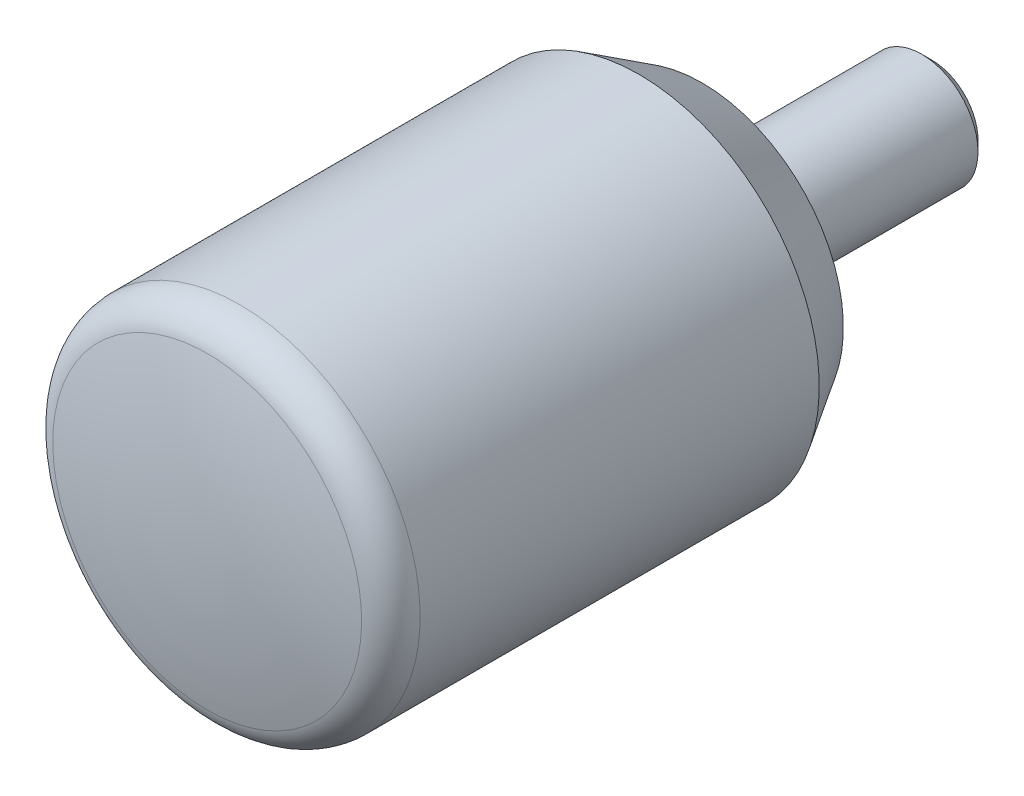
ISO-10303-21;
HEADER;
FILE_DESCRIPTION(('STEP AP214'),'2;1');
FILE_NAME('part.step','',(''),(''),'','','');
FILE_SCHEMA(('AUTOMOTIVE_DESIGN { 1 0 10303 214 1 1 1 1 }'));
ENDSEC;
DATA;
#1=APPLICATION_CONTEXT('core data for automotive mechanical design processes');
#2=APPLICATION_PROTOCOL_DEFINITION('international standard','automotive_design',2000,#1);
#3=PRODUCT_CONTEXT('',#1,'mechanical');
#4=PRODUCT('Part','Part','',(#3));
#5=PRODUCT_RELATED_PRODUCT_CATEGORY('part','',(#4));
#6=PRODUCT_DEFINITION_FORMATION('','',#4);
#7=PRODUCT_DEFINITION_CONTEXT('part definition',#1,'design');
#8=PRODUCT_DEFINITION('design','',#6,#7);
#9=PRODUCT_DEFINITION_SHAPE('','',#8);
#10=(LENGTH_UNIT() NAMED_UNIT(*) SI_UNIT(.MILLI.,.METRE.));
#11=(NAMED_UNIT(*) PLANE_ANGLE_UNIT() SI_UNIT($,.RADIAN.));
#12=(NAMED_UNIT(*) SI_UNIT($,.STERADIAN.) SOLID_ANGLE_UNIT());
#13=UNCERTAINTY_MEASURE_WITH_UNIT(LENGTH_MEASURE(1.E-05),#10,'distance_accuracy_value','');
#14=(GEOMETRIC_REPRESENTATION_CONTEXT(3) GLOBAL_UNCERTAINTY_ASSIGNED_CONTEXT((#13)) GLOBAL_UNIT_ASSIGNED_CONTEXT((#10,
#11,#12)) REPRESENTATION_CONTEXT('',''));
#15=CARTESIAN_POINT('',(0.,0.,0.));
#16=DIRECTION('',(0.,0.,1.));
#17=DIRECTION('',(1.,0.,0.));
#18=AXIS2_PLACEMENT_3D('',#15,#16,#17);
#19=CARTESIAN_POINT('',(0.,2.5000000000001,0.));
#20=DIRECTION('',(0.,0.,-1.));
#21=DIRECTION('',(0.,-1.,0.));
#22=AXIS2_PLACEMENT_3D('',#19,#20,#21);
#23=PLANE('',#22);
#24=CARTESIAN_POINT('',(0.,0.,0.));
#25=DIRECTION('',(0.,0.,-1.));
#26=DIRECTION('',(0.,-1.,0.));
#27=AXIS2_PLACEMENT_3D('',#24,#25,#26);
#28=CIRCLE('',#27,4.00000000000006);
#29=CARTESIAN_POINT('',(0.,-4.00000000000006,0.));
#30=VERTEX_POINT('',#29);
#31=EDGE_CURVE('E116',#30,#30,#28,.T.);
#32=ORIENTED_EDGE('',*,*,#31,.T.);
#33=EDGE_LOOP('',(#32));
#34=FACE_BOUND('',#33,.T.);
#35=CARTESIAN_POINT('',(0.,0.,0.));
#36=DIRECTION('',(0.,0.,-1.));
#37=DIRECTION('',(0.,-1.,0.));
#38=AXIS2_PLACEMENT_3D('',#35,#36,#37);
#39=CIRCLE('',#38,2.50000000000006);
#40=CARTESIAN_POINT('',(0.,-2.50000000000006,0.));
#41=VERTEX_POINT('',#40);
#42=EDGE_CURVE('E139',#41,#41,#39,.T.);
#43=ORIENTED_EDGE('',*,*,#42,.F.);
#44=EDGE_LOOP('',(#43));
#45=FACE_BOUND('',#44,.T.);
#46=ADVANCED_FACE('F14',(#34,#45),#23,.T.);
#47=CARTESIAN_POINT('',(0.,0.,-15.2));
#48=DIRECTION('',(0.,0.,-1.));
#49=DIRECTION('',(0.,-1.,0.));
#50=AXIS2_PLACEMENT_3D('',#47,#48,#49);
#51=CYLINDRICAL_SURFACE('',#50,2.50000000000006);
#52=CARTESIAN_POINT('',(0.,0.,-9.55));
#53=DIRECTION('',(0.,0.,-1.));
#54=DIRECTION('',(0.,1.,0.));
#55=AXIS2_PLACEMENT_3D('',#52,#53,#54);
#56=CIRCLE('',#55,2.50000000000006);
#57=CARTESIAN_POINT('',(0.,2.50000000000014,-9.55));
#58=VERTEX_POINT('',#57);
#59=EDGE_CURVE('E9',#58,#58,#56,.F.);
#60=ORIENTED_EDGE('',*,*,#59,.T.);
#61=EDGE_LOOP('',(#60));
#62=FACE_BOUND('',#61,.T.);
#63=ORIENTED_EDGE('',*,*,#42,.T.);
#64=EDGE_LOOP('',(#63));
#65=FACE_BOUND('',#64,.T.);
#66=ADVANCED_FACE('F158',(#62,#65),#51,.T.);
#67=CARTESIAN_POINT('',(0.,1.2490009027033E-13,-10.));
#68=DIRECTION('',(0.,0.,-1.));
#69=DIRECTION('',(0.,-1.,0.));
#70=AXIS2_PLACEMENT_3D('',#67,#68,#69);
#71=PLANE('',#70);
#72=CARTESIAN_POINT('',(0.,0.,-10.));
#73=DIRECTION('',(0.,0.,-1.));
#74=DIRECTION('',(0.,1.,0.));
#75=AXIS2_PLACEMENT_3D('',#72,#73,#74);
#76=CIRCLE('',#75,2.05);
#77=CARTESIAN_POINT('',(0.,2.05000000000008,-10.));
#78=VERTEX_POINT('',#77);
#79=EDGE_CURVE('E22',#78,#78,#76,.T.);
#80=ORIENTED_EDGE('',*,*,#79,.T.);
#81=EDGE_LOOP('',(#80));
#82=FACE_BOUND('',#81,.T.);
#83=DIRECTION('',(0.866025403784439,0.5,0.));
#84=VECTOR('',#83,1.);
#85=CARTESIAN_POINT('',(-1.25,0.721687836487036,-10.));
#86=LINE('',#85,#84);
#87=CARTESIAN_POINT('',(-1.25,0.721687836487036,-10.));
#88=VERTEX_POINT('',#87);
#89=CARTESIAN_POINT('',(0.,1.44337567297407,-10.));
#90=VERTEX_POINT('',#89);
#91=EDGE_CURVE('E29',#88,#90,#86,.T.);
#92=ORIENTED_EDGE('',*,*,#91,.F.);
#93=DIRECTION('',(0.,1.,0.));
#94=VECTOR('',#93,1.);
#95=CARTESIAN_POINT('',(-1.25,-0.72168783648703,-10.));
#96=LINE('',#95,#94);
#97=CARTESIAN_POINT('',(-1.25,-0.72168783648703,-10.));
#98=VERTEX_POINT('',#97);
#99=EDGE_CURVE('E112',#98,#88,#96,.T.);
#100=ORIENTED_EDGE('',*,*,#99,.F.);
#101=DIRECTION('',(-0.866025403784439,0.5,0.));
#102=VECTOR('',#101,1.);
#103=CARTESIAN_POINT('',(0.,-1.44337567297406,-10.));
#104=LINE('',#103,#102);
#105=CARTESIAN_POINT('',(0.,-1.44337567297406,-10.));
#106=VERTEX_POINT('',#105);
#107=EDGE_CURVE('E110',#106,#98,#104,.T.);
#108=ORIENTED_EDGE('',*,*,#107,.F.);
#109=DIRECTION('',(-0.866025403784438,-0.5,0.));
#110=VECTOR('',#109,1.);
#111=CARTESIAN_POINT('',(1.25,-0.72168783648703,-10.));
#112=LINE('',#111,#110);
#113=CARTESIAN_POINT('',(1.25,-0.72168783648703,-10.));
#114=VERTEX_POINT('',#113);
#115=EDGE_CURVE('E77',#114,#106,#112,.T.);
#116=ORIENTED_EDGE('',*,*,#115,.F.);
#117=DIRECTION('',(0.,-1.,0.));
#118=VECTOR('',#117,1.);
#119=CARTESIAN_POINT('',(1.25,0.721687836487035,-10.));
#120=LINE('',#119,#118);
#121=CARTESIAN_POINT('',(1.25,0.721687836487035,-10.));
#122=VERTEX_POINT('',#121);
#123=EDGE_CURVE('E106',#122,#114,#120,.T.);
#124=ORIENTED_EDGE('',*,*,#123,.F.);
#125=DIRECTION('',(0.866025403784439,-0.5,0.));
#126=VECTOR('',#125,1.);
#127=CARTESIAN_POINT('',(0.,1.44337567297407,-10.));
#128=LINE('',#127,#126);
#129=EDGE_CURVE('E103',#90,#122,#128,.T.);
#130=ORIENTED_EDGE('',*,*,#129,.F.);
#131=EDGE_LOOP('',(#92,#100,#108,#116,#124,#130));
#132=FACE_BOUND('',#131,.T.);
#133=ADVANCED_FACE('F144',(#82,#132),#71,.T.);
#134=CARTESIAN_POINT('',(0.,0.,-5.90000000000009));
#135=DIRECTION('',(-1.,0.,0.));
#136=DIRECTION('',(0.,0.,1.));
#137=AXIS2_PLACEMENT_3D('',#134,#135,#136);
#138=SPHERICAL_SURFACE('',#137,28.9);
#139=CARTESIAN_POINT('',(0.,0.,-5.90000000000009));
#140=DIRECTION('',(0.,0.,-1.));
#141=DIRECTION('',(0.,-1.,0.));
#142=AXIS2_PLACEMENT_3D('',#139,#140,#141);
#143=SPHERICAL_SURFACE('',#142,28.9);
#144=CARTESIAN_POINT('',(0.,0.,22.1750327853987));
#145=DIRECTION('',(0.,0.,-1.));
#146=DIRECTION('',(0.,-1.,0.));
#147=AXIS2_PLACEMENT_3D('',#144,#145,#146);
#148=CIRCLE('',#147,6.85583941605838);
#149=CARTESIAN_POINT('',(0.,-6.85583941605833,22.1750327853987));
#150=VERTEX_POINT('',#149);
#151=EDGE_CURVE('E136',#150,#150,#148,.T.);
#152=ORIENTED_EDGE('',*,*,#151,.F.);
#153=EDGE_LOOP('',(#152));
#154=FACE_BOUND('',#153,.T.);
#155=ADVANCED_FACE('F170',(#154),#143,.T.);
#156=CARTESIAN_POINT('',(0.,0.,20.7178511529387));
#157=DIRECTION('',(0.,0.,-1.));
#158=DIRECTION('',(0.,-1.,0.));
#159=AXIS2_PLACEMENT_3D('',#156,#157,#158);
#160=TOROIDAL_SURFACE('',#159,6.5,1.50000000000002);
#161=CARTESIAN_POINT('',(0.,0.,20.7178511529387));
#162=DIRECTION('',(0.,0.,-1.));
#163=DIRECTION('',(0.,-1.,0.));
#164=AXIS2_PLACEMENT_3D('',#161,#162,#163);
#165=CIRCLE('',#164,8.);
#166=CARTESIAN_POINT('',(0.,-7.99999999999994,20.7178511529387));
#167=VERTEX_POINT('',#166);
#168=EDGE_CURVE('E133',#167,#167,#165,.T.);
#169=ORIENTED_EDGE('',*,*,#168,.F.);
#170=EDGE_LOOP('',(#169));
#171=FACE_BOUND('',#170,.T.);
#172=ORIENTED_EDGE('',*,*,#151,.T.);
#173=EDGE_LOOP('',(#172));
#174=FACE_BOUND('',#173,.T.);
#175=ADVANCED_FACE('F173',(#171,#174),#160,.T.);
#176=CARTESIAN_POINT('',(0.,0.,-15.2));
#177=DIRECTION('',(0.,0.,-1.));
#178=DIRECTION('',(0.,-1.,0.));
#179=AXIS2_PLACEMENT_3D('',#176,#177,#178);
#180=CYLINDRICAL_SURFACE('',#179,8.);
#181=CARTESIAN_POINT('',(0.,0.,2.99999999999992));
#182=DIRECTION('',(0.,0.,-1.));
#183=DIRECTION('',(0.,-1.,0.));
#184=AXIS2_PLACEMENT_3D('',#181,#182,#183);
#185=CIRCLE('',#184,8.);
#186=CARTESIAN_POINT('',(0.,-7.99999999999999,2.99999999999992));
#187=VERTEX_POINT('',#186);
#188=EDGE_CURVE('E130',#187,#187,#185,.T.);
#189=ORIENTED_EDGE('',*,*,#188,.F.);
#190=EDGE_LOOP('',(#189));
#191=FACE_BOUND('',#190,.T.);
#192=ORIENTED_EDGE('',*,*,#168,.T.);
#193=EDGE_LOOP('',(#192));
#194=FACE_BOUND('',#193,.T.);
#195=ADVANCED_FACE('F177',(#191,#194),#180,.T.);
#196=CARTESIAN_POINT('',(0.,0.,0.200000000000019));
#197=DIRECTION('',(0.,0.,1.));
#198=DIRECTION('',(0.,1.,0.));
#199=AXIS2_PLACEMENT_3D('',#196,#197,#198);
#200=CONICAL_SURFACE('',#199,6.27256140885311,0.552784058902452);
#201=ORIENTED_EDGE('',*,*,#188,.T.);
#202=EDGE_LOOP('',(#201));
#203=FACE_BOUND('',#202,.T.);
#204=CARTESIAN_POINT('',(0.,0.,0.200000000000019));
#205=DIRECTION('',(0.,0.,-1.));
#206=DIRECTION('',(0.,-1.,0.));
#207=AXIS2_PLACEMENT_3D('',#204,#205,#206);
#208=CIRCLE('',#207,6.27256140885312);
#209=CARTESIAN_POINT('',(0.,-6.27256140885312,0.200000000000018));
#210=VERTEX_POINT('',#209);
#211=EDGE_CURVE('E127',#210,#210,#208,.T.);
#212=ORIENTED_EDGE('',*,*,#211,.F.);
#213=EDGE_LOOP('',(#212));
#214=FACE_BOUND('',#213,.T.);
#215=ADVANCED_FACE('F181',(#203,#214),#200,.T.);
#216=CARTESIAN_POINT('',(0.,4.0000000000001,0.199999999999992));
#217=DIRECTION('',(0.,0.,-1.));
#218=DIRECTION('',(0.,-1.,0.));
#219=AXIS2_PLACEMENT_3D('',#216,#217,#218);
#220=PLANE('',#219);
#221=ORIENTED_EDGE('',*,*,#211,.T.);
#222=EDGE_LOOP('',(#221));
#223=FACE_BOUND('',#222,.T.);
#224=CARTESIAN_POINT('',(0.,0.,0.199999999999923));
#225=DIRECTION('',(0.,0.,-1.));
#226=DIRECTION('',(0.,-1.,0.));
#227=AXIS2_PLACEMENT_3D('',#224,#225,#226);
#228=CIRCLE('',#227,4.00000000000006);
#229=CARTESIAN_POINT('',(0.,-4.00000000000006,0.199999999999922));
#230=VERTEX_POINT('',#229);
#231=EDGE_CURVE('E124',#230,#230,#228,.T.);
#232=ORIENTED_EDGE('',*,*,#231,.F.);
#233=EDGE_LOOP('',(#232));
#234=FACE_BOUND('',#233,.T.);
#235=ADVANCED_FACE('F185',(#223,#234),#220,.T.);
#236=CARTESIAN_POINT('',(0.,0.,-15.2));
#237=DIRECTION('',(0.,0.,-1.));
#238=DIRECTION('',(0.,-1.,0.));
#239=AXIS2_PLACEMENT_3D('',#236,#237,#238);
#240=CYLINDRICAL_SURFACE('',#239,4.00000000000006);
#241=ORIENTED_EDGE('',*,*,#231,.T.);
#242=EDGE_LOOP('',(#241));
#243=FACE_BOUND('',#242,.T.);
#244=ORIENTED_EDGE('',*,*,#31,.F.);
#245=EDGE_LOOP('',(#244));
#246=FACE_BOUND('',#245,.T.);
#247=ADVANCED_FACE('F189',(#243,#246),#240,.T.);
#248=CARTESIAN_POINT('',(-1.25,0.721687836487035,-7.));
#249=DIRECTION('',(-0.5,0.866025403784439,0.));
#250=DIRECTION('',(-0.866025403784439,-0.5,0.));
#251=AXIS2_PLACEMENT_3D('',#248,#249,#250);
#252=PLANE('',#251);
#253=ORIENTED_EDGE('',*,*,#91,.T.);
#254=DIRECTION('',(0.,0.,-1.));
#255=VECTOR('',#254,1.);
#256=CARTESIAN_POINT('',(0.,1.44337567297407,-7.));
#257=LINE('',#256,#255);
#258=CARTESIAN_POINT('',(0.,1.44337567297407,-7.));
#259=VERTEX_POINT('',#258);
#260=EDGE_CURVE('E59',#259,#90,#257,.T.);
#261=ORIENTED_EDGE('',*,*,#260,.F.);
#262=DIRECTION('',(0.866025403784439,0.5,0.));
#263=VECTOR('',#262,1.);
#264=CARTESIAN_POINT('',(-1.25,0.721687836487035,-7.));
#265=LINE('',#264,#263);
#266=CARTESIAN_POINT('',(-1.25,0.721687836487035,-7.));
#267=VERTEX_POINT('',#266);
#268=EDGE_CURVE('E114',#267,#259,#265,.T.);
#269=ORIENTED_EDGE('',*,*,#268,.F.);
#270=DIRECTION('',(0.,0.,-1.));
#271=VECTOR('',#270,1.);
#272=CARTESIAN_POINT('',(-1.25,0.721687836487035,-7.));
#273=LINE('',#272,#271);
#274=EDGE_CURVE('E37',#267,#88,#273,.T.);
#275=ORIENTED_EDGE('',*,*,#274,.T.);
#276=EDGE_LOOP('',(#253,#261,#269,#275));
#277=FACE_BOUND('',#276,.T.);
#278=ADVANCED_FACE('F193',(#277),#252,.F.);
#279=CARTESIAN_POINT('',(-1.25,-0.721687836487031,-7.));
#280=DIRECTION('',(-1.,0.,0.));
#281=DIRECTION('',(0.,0.,1.));
#282=AXIS2_PLACEMENT_3D('',#279,#280,#281);
#283=PLANE('',#282);
#284=ORIENTED_EDGE('',*,*,#99,.T.);
#285=ORIENTED_EDGE('',*,*,#274,.F.);
#286=DIRECTION('',(0.,1.,0.));
#287=VECTOR('',#286,1.);
#288=CARTESIAN_POINT('',(-1.25,-0.721687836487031,-7.));
#289=LINE('',#288,#287);
#290=CARTESIAN_POINT('',(-1.25,-0.721687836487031,-7.));
#291=VERTEX_POINT('',#290);
#292=EDGE_CURVE('E89',#291,#267,#289,.T.);
#293=ORIENTED_EDGE('',*,*,#292,.F.);
#294=DIRECTION('',(0.,0.,-1.));
#295=VECTOR('',#294,1.);
#296=CARTESIAN_POINT('',(-1.25,-0.721687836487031,-7.));
#297=LINE('',#296,#295);
#298=EDGE_CURVE('E81',#291,#98,#297,.T.);
#299=ORIENTED_EDGE('',*,*,#298,.T.);
#300=EDGE_LOOP('',(#284,#285,#293,#299));
#301=FACE_BOUND('',#300,.T.);
#302=ADVANCED_FACE('F197',(#301),#283,.F.);
#303=CARTESIAN_POINT('',(0.,-1.44337567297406,-7.));
#304=DIRECTION('',(-0.5,-0.866025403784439,0.));
#305=DIRECTION('',(0.866025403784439,-0.5,0.));
#306=AXIS2_PLACEMENT_3D('',#303,#304,#305);
#307=PLANE('',#306);
#308=ORIENTED_EDGE('',*,*,#107,.T.);
#309=ORIENTED_EDGE('',*,*,#298,.F.);
#310=DIRECTION('',(-0.866025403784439,0.5,0.));
#311=VECTOR('',#310,1.);
#312=CARTESIAN_POINT('',(0.,-1.44337567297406,-7.));
#313=LINE('',#312,#311);
#314=CARTESIAN_POINT('',(0.,-1.44337567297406,-7.));
#315=VERTEX_POINT('',#314);
#316=EDGE_CURVE('E85',#315,#291,#313,.T.);
#317=ORIENTED_EDGE('',*,*,#316,.F.);
#318=DIRECTION('',(0.,0.,-1.));
#319=VECTOR('',#318,1.);
#320=CARTESIAN_POINT('',(0.,-1.44337567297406,-7.));
#321=LINE('',#320,#319);
#322=EDGE_CURVE('E70',#315,#106,#321,.T.);
#323=ORIENTED_EDGE('',*,*,#322,.T.);
#324=EDGE_LOOP('',(#308,#309,#317,#323));
#325=FACE_BOUND('',#324,.T.);
#326=ADVANCED_FACE('F86',(#325),#307,.F.);
#327=CARTESIAN_POINT('',(1.25,-0.721687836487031,-7.));
#328=DIRECTION('',(0.5,-0.866025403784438,0.));
#329=DIRECTION('',(0.866025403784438,0.5,0.));
#330=AXIS2_PLACEMENT_3D('',#327,#328,#329);
#331=PLANE('',#330);
#332=ORIENTED_EDGE('',*,*,#115,.T.);
#333=ORIENTED_EDGE('',*,*,#322,.F.);
#334=DIRECTION('',(-0.866025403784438,-0.5,0.));
#335=VECTOR('',#334,1.);
#336=CARTESIAN_POINT('',(1.25,-0.721687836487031,-7.));
#337=LINE('',#336,#335);
#338=CARTESIAN_POINT('',(1.25,-0.721687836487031,-7.));
#339=VERTEX_POINT('',#338);
#340=EDGE_CURVE('E74',#339,#315,#337,.T.);
#341=ORIENTED_EDGE('',*,*,#340,.F.);
#342=DIRECTION('',(0.,0.,-1.));
#343=VECTOR('',#342,1.);
#344=CARTESIAN_POINT('',(1.25,-0.721687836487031,-7.));
#345=LINE('',#344,#343);
#346=EDGE_CURVE('E82',#339,#114,#345,.T.);
#347=ORIENTED_EDGE('',*,*,#346,.T.);
#348=EDGE_LOOP('',(#332,#333,#341,#347));
#349=FACE_BOUND('',#348,.T.);
#350=ADVANCED_FACE('F72',(#349),#331,.F.);
#351=CARTESIAN_POINT('',(1.25,0.721687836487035,-7.));
#352=DIRECTION('',(1.,0.,0.));
#353=DIRECTION('',(0.,1.,0.));
#354=AXIS2_PLACEMENT_3D('',#351,#352,#353);
#355=PLANE('',#354);
#356=ORIENTED_EDGE('',*,*,#123,.T.);
#357=ORIENTED_EDGE('',*,*,#346,.F.);
#358=DIRECTION('',(0.,-1.,0.));
#359=VECTOR('',#358,1.);
#360=CARTESIAN_POINT('',(1.25,0.721687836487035,-7.));
#361=LINE('',#360,#359);
#362=CARTESIAN_POINT('',(1.25,0.721687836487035,-7.));
#363=VERTEX_POINT('',#362);
#364=EDGE_CURVE('E95',#363,#339,#361,.T.);
#365=ORIENTED_EDGE('',*,*,#364,.F.);
#366=DIRECTION('',(0.,0.,-1.));
#367=VECTOR('',#366,1.);
#368=CARTESIAN_POINT('',(1.25,0.721687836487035,-7.));
#369=LINE('',#368,#367);
#370=EDGE_CURVE('E119',#363,#122,#369,.T.);
#371=ORIENTED_EDGE('',*,*,#370,.T.);
#372=EDGE_LOOP('',(#356,#357,#365,#371));
#373=FACE_BOUND('',#372,.T.);
#374=ADVANCED_FACE('F200',(#373),#355,.F.);
#375=CARTESIAN_POINT('',(0.,1.44337567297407,-7.));
#376=DIRECTION('',(0.5,0.866025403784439,0.));
#377=DIRECTION('',(-0.866025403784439,0.5,0.));
#378=AXIS2_PLACEMENT_3D('',#375,#376,#377);
#379=PLANE('',#378);
#380=ORIENTED_EDGE('',*,*,#129,.T.);
#381=ORIENTED_EDGE('',*,*,#370,.F.);
#382=DIRECTION('',(0.866025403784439,-0.5,0.));
#383=VECTOR('',#382,1.);
#384=CARTESIAN_POINT('',(0.,1.44337567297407,-7.));
#385=LINE('',#384,#383);
#386=EDGE_CURVE('E97',#259,#363,#385,.T.);
#387=ORIENTED_EDGE('',*,*,#386,.F.);
#388=ORIENTED_EDGE('',*,*,#260,.T.);
#389=EDGE_LOOP('',(#380,#381,#387,#388));
#390=FACE_BOUND('',#389,.T.);
#391=ADVANCED_FACE('F154',(#390),#379,.F.);
#392=CARTESIAN_POINT('',(0.,1.44337567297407,-7.));
#393=DIRECTION('',(0.,0.,-1.));
#394=DIRECTION('',(-1.,0.,0.));
#395=AXIS2_PLACEMENT_3D('',#392,#393,#394);
#396=PLANE('',#395);
#397=ORIENTED_EDGE('',*,*,#268,.T.);
#398=ORIENTED_EDGE('',*,*,#386,.T.);
#399=ORIENTED_EDGE('',*,*,#364,.T.);
#400=ORIENTED_EDGE('',*,*,#340,.T.);
#401=ORIENTED_EDGE('',*,*,#316,.T.);
#402=ORIENTED_EDGE('',*,*,#292,.T.);
#403=EDGE_LOOP('',(#397,#398,#399,#400,#401,#402));
#404=FACE_BOUND('',#403,.T.);
#405=ADVANCED_FACE('F92',(#404),#396,.T.);
#406=CARTESIAN_POINT('',(0.,0.,-10.));
#407=DIRECTION('',(0.,0.,1.));
#408=DIRECTION('',(0.,-1.,0.));
#409=AXIS2_PLACEMENT_3D('',#406,#407,#408);
#410=CONICAL_SURFACE('',#409,2.05,0.785398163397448);
#411=ORIENTED_EDGE('',*,*,#59,.F.);
#412=EDGE_LOOP('',(#411));
#413=FACE_BOUND('',#412,.T.);
#414=ORIENTED_EDGE('',*,*,#79,.F.);
#415=EDGE_LOOP('',(#414));
#416=FACE_BOUND('',#415,.T.);
#417=ADVANCED_FACE('F16',(#413,#416),#410,.T.);
#418=CLOSED_SHELL('',(#46,#66,#133,#155,#175,#195,#215,#235,#247,#278,#302,#326,#350,#374,#391,
#405,#417));
#419=MANIFOLD_SOLID_BREP('B1',#418);
#420=ADVANCED_BREP_SHAPE_REPRESENTATION('',(#18,#419),#14);
#421=SHAPE_DEFINITION_REPRESENTATION(#9,#420);
ENDSEC;
END-ISO-10303-21;
